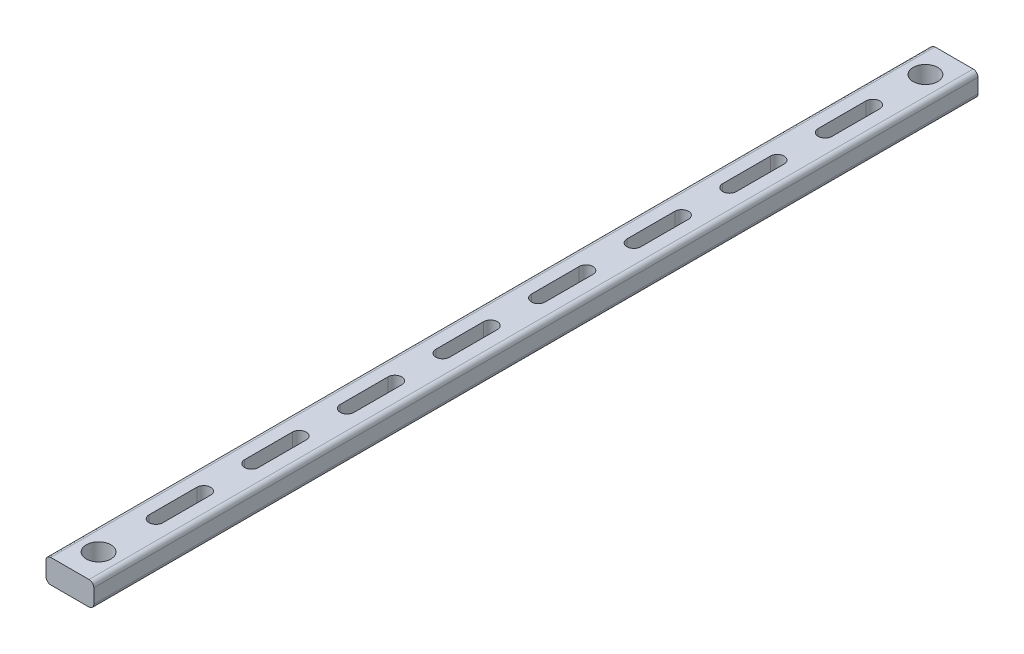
from build123d import *

# Parameters (mm, degrees)
BOSS_EXTRUDE1_DEPTH      = 58.7375
BOSS_EXTRUDE1_DEPTH_BACK = 58.7375
SKETCH4_R                = 1.6383
CUT_EXTRUDE1_DEPTH       = 59.908871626
CUT_EXTRUDE2_DEPTH       = 59.908871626
LPATTERN1_COUNT          = 8
LPATTERN1_PITCH          = 12.7


with BuildPart() as part:
    # Sketch3 → Boss-Extrude1 (new, two sides: drawn at the far end of the back side and taken through both)
    with BuildSketch(Plane.XY.offset(-BOSS_EXTRUDE1_DEPTH_BACK)):
        with BuildLine():
            Line((2.54, 1.5875), (-2.54, 1.5875))
            ThreePointArc((-2.54, 1.5875), (-2.989012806, 1.401512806), (-3.175, 0.9525))
            Line((-3.175, 0.9525), (-3.175, -0.9525))
            ThreePointArc((-3.175, -0.9525), (-2.989012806, -1.401512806), (-2.54, -1.5875))
            Line((-2.54, -1.5875), (2.54, -1.5875))
            ThreePointArc((2.54, -1.5875), (2.989012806, -1.401512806), (3.175, -0.9525))
            Line((3.175, -0.9525), (3.175, 0.9525))
            ThreePointArc((3.175, 0.9525), (2.989012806, 1.401512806), (2.54, 1.5875))
        make_face()
    extrude(amount=BOSS_EXTRUDE1_DEPTH + BOSS_EXTRUDE1_DEPTH_BACK)

    # Sketch4 → Cut-Extrude1 (cut, through all)
    with BuildSketch(Plane(origin=(0, 1.5875, 0), x_dir=(1, 0, 0), z_dir=(0, 1, 0))):
        with Locations(Location((0, -54.9275, 0), (0, 0, 270))):
            Circle(SKETCH4_R)
        with Locations(Location((0, 54.9275, 0), (0, 0, 270))):
            Circle(SKETCH4_R)
    extrude(amount=-CUT_EXTRUDE1_DEPTH, mode=Mode.SUBTRACT)

    # Sketch5 → Cut-Extrude2 (cut, through all)
    with BuildSketch(Plane(origin=(0, 1.5875, 0), x_dir=(1, 0, 0), z_dir=(0, 1, 0))):
        with BuildLine():
            Line((-0.9144, -47.3075), (-0.9144, -40.9575))
            ThreePointArc((-0.9144, -40.9575), (0, -40.0431), (0.9144, -40.9575))
            Line((0.9144, -40.9575), (0.9144, -47.3075))
            ThreePointArc((0.9144, -47.3075), (0, -48.2219), (-0.9144, -47.3075))
        make_face()
    cut_extrude2 = extrude(amount=-CUT_EXTRUDE2_DEPTH, mode=Mode.SUBTRACT)

    # LPattern1: Cut-Extrude2 ×8
    with Locations(*[(0, 0, -i * LPATTERN1_PITCH) for i in range(1, LPATTERN1_COUNT)]):
        add(cut_extrude2, mode=Mode.SUBTRACT)


solid = part.part
